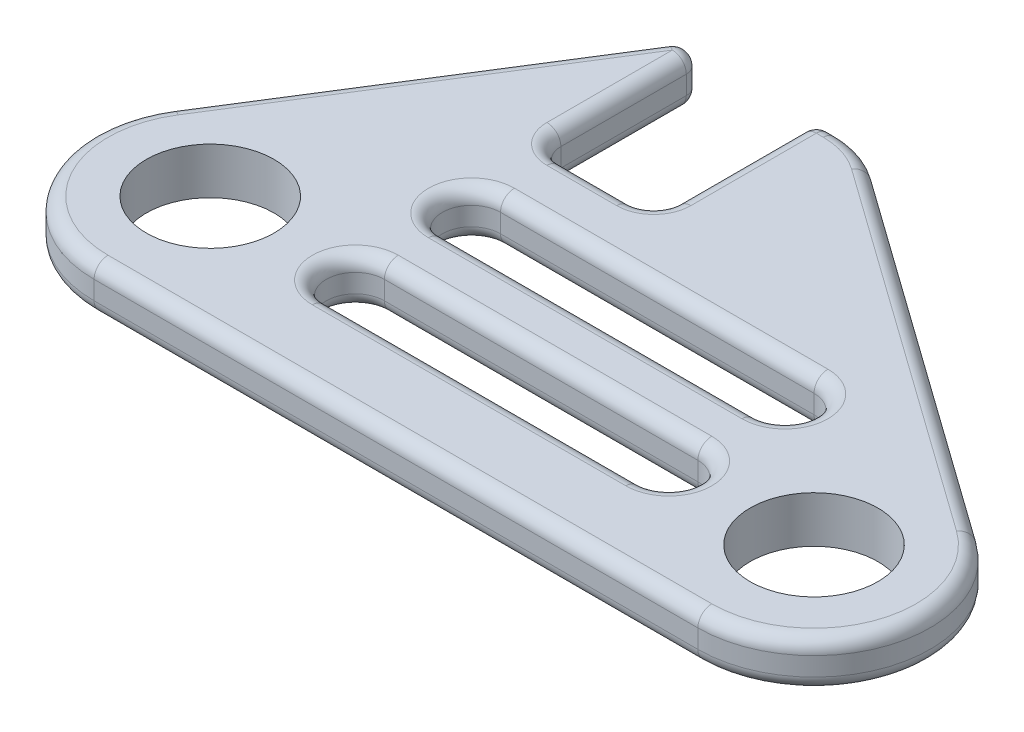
from build123d import *

# Parameters (mm, degrees)
ESQUISSE1_R        = 2.75
BOSS_EXTRU_1_DEPTH = 2
CONG_1_R           = 0.6
CONG_2_R           = 0.6


with BuildPart() as part:
    # Esquisse1 → Boss.-Extru.1 (new body)
    with BuildSketch(Plane(origin=(0, 0, 0), x_dir=(1, 0, 0), z_dir=(0, 1, 0))):
        with BuildLine():
            Line((0.137869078, 15.316103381), (15.903514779, 4.070577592))
            ThreePointArc((15.903514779, 4.070577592), (17.761978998, -1.524321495), (13, -5))
            Line((13, -5), (-13, -5))
            ThreePointArc((-13, -5), (-17.377445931, -2.416188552), (-17.230693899, 2.664813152))
            Line((-17.230693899, 2.664813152), (-9.007683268, 15.719777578))
            ThreePointArc((-9.007683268, 15.719777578), (-8.333581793, 15.976459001), (-7.9, 15.4))
            Line((-7.9, 15.4), (-7.9, 10))
            ThreePointArc((-7.9, 10), (-7.607106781, 9.292893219), (-6.9, 9))
            Line((-6.9, 9), (-3.9, 9))
            ThreePointArc((-3.9, 9), (-3.192893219, 9.292893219), (-2.9, 10))
            Line((-2.9, 10), (-2.9, 15.4))
            ThreePointArc((-2.9, 15.4), (-2.724264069, 15.824264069), (-2.3, 16))
            Line((-2.3, 16), (-1.998623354, 16))
            ThreePointArc((-1.998623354, 16), (-0.876982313, 15.824857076), (0.137869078, 15.316103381))
        make_face()
        with Locations(Location((13, 0, 0), (0, 0, 270))):
            Circle(ESQUISSE1_R, mode=Mode.SUBTRACT)
        with Locations(Location((-13, 0, 0), (0, 0, 90))):
            Circle(ESQUISSE1_R, mode=Mode.SUBTRACT)
        with BuildLine():
            Line((-6.75, 1.25), (6.75, 1.25))
            ThreePointArc((6.75, 1.25), (8, 0), (6.75, -1.25))
            Line((6.75, -1.25), (-6.75, -1.25))
            ThreePointArc((-6.75, -1.25), (-8, 0), (-6.75, 1.25))
        make_face(mode=Mode.SUBTRACT)
        with BuildLine():
            Line((-6.75, 6.25), (6.75, 6.25))
            ThreePointArc((6.75, 6.25), (8, 5), (6.75, 3.75))
            Line((6.75, 3.75), (-6.75, 3.75))
            ThreePointArc((-6.75, 3.75), (-8, 5), (-6.75, 6.25))
        make_face(mode=Mode.SUBTRACT)
    extrude(amount=BOSS_EXTRU_1_DEPTH)

    # Cong_1
    cong_1_edges = [part.edges().sort_by_distance(p)[0] for p in [
        (17.761978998, 2, 1.524321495),
        (-13.119188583, 0, -9.192295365),
        (-8.333581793, 0, -15.976459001),
        (8.020691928, 2, -9.693340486),
        (-7.9, 0, -12.7),
        (-7.607106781, 0, -9.292893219),
        (-5.4, 0, -9),
        (-3.192893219, 0, -9.292893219),
        (-2.9, 0, -12.7),
        (-2.724264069, 0, -15.824264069),
        (-2.149311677, 0, -16),
        (-0.876982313, 2, -15.824857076),
        (-0.876982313, 0, -15.824857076),
        (8.020691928, 0, -9.693340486),
        (17.761978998, 0, 1.524321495),
        (0, 0, 5),
        (-17.377445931, 0, 2.416188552),
        (-2.149311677, 2, -16),
        (-2.724264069, 2, -15.824264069),
        (-2.9, 2, -12.7),
        (-3.192893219, 2, -9.292893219),
        (-5.4, 2, -9),
        (-7.607106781, 2, -9.292893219),
        (-7.9, 2, -12.7),
        (-17.377445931, 2, 2.416188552),
        (-8.333581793, 2, -15.976459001),
        (-13.119188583, 2, -9.192295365),
        (0, 2, 5),
    ]]
    fillet(cong_1_edges, radius=CONG_1_R)

    # Cong_2
    cong_2_edges = [part.edges().sort_by_distance(p)[0] for p in [
        (8, 0, 0),
        (0, 0, -1.25),
        (-8, 0, 0),
        (0, 0, 1.25),
        (8, 2, 0),
        (0, 2, -1.25),
        (-8, 2, 0),
        (0, 2, 1.25),
        (8, 0, -5),
        (0, 0, -6.25),
        (-8, 0, -5),
        (0, 0, -3.75),
        (8, 2, -5),
        (0, 2, -6.25),
        (-8, 2, -5),
        (0, 2, -3.75),
    ]]
    fillet(cong_2_edges, radius=CONG_2_R)


solid = part.part
